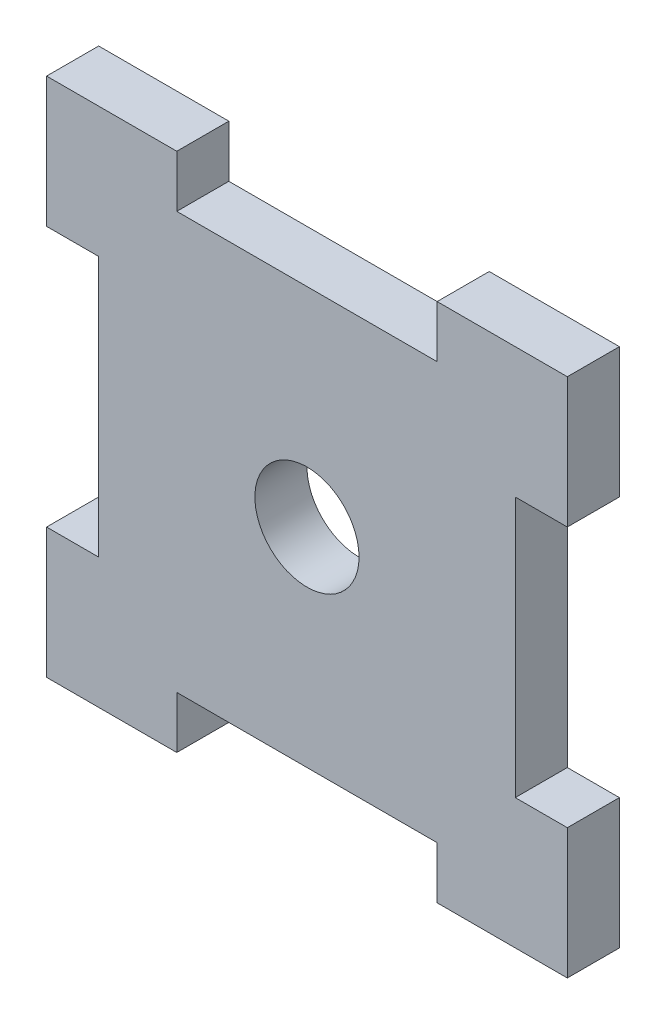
from build123d import *

# Parameters (mm, degrees)
CROQUIS1_R              = 3
SALIENTE_EXTRUIR1_DEPTH = 3


with BuildPart() as part:
    # Croquis1 → Saliente-Extruir1 (new body)
    with BuildSketch(Plane.XY):
        Polygon((22.5, 0), (30, 0), (30, 7.5), (27, 7.5), (27, 22.5), (30, 22.5), (30, 30), (22.5, 30), (22.5, 27), (7.5, 27), (7.5, 30), (0, 30), (0, 22.5), (3, 22.5), (3, 7.5), (0, 7.5), (0, 0), (7.5, 0), (7.5, 3), (22.5, 3), align=None)
        with Locations((15, 15)):
            Circle(CROQUIS1_R, mode=Mode.SUBTRACT)
    extrude(amount=SALIENTE_EXTRUIR1_DEPTH)


solid = part.part
